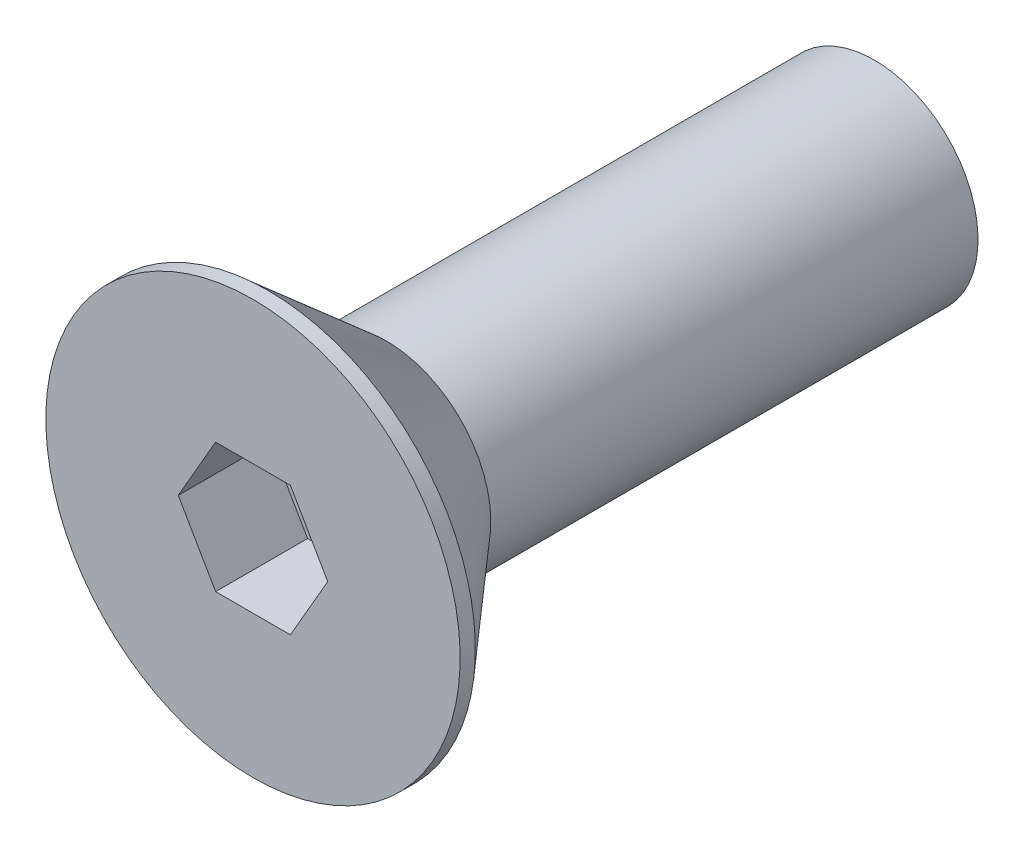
ISO-10303-21;
HEADER;
FILE_DESCRIPTION(('STEP AP214'),'2;1');
FILE_NAME('part.step','',(''),(''),'','','');
FILE_SCHEMA(('AUTOMOTIVE_DESIGN { 1 0 10303 214 1 1 1 1 }'));
ENDSEC;
DATA;
#1=APPLICATION_CONTEXT('core data for automotive mechanical design processes');
#2=APPLICATION_PROTOCOL_DEFINITION('international standard','automotive_design',2000,#1);
#3=PRODUCT_CONTEXT('',#1,'mechanical');
#4=PRODUCT('Part','Part','',(#3));
#5=PRODUCT_RELATED_PRODUCT_CATEGORY('part','',(#4));
#6=PRODUCT_DEFINITION_FORMATION('','',#4);
#7=PRODUCT_DEFINITION_CONTEXT('part definition',#1,'design');
#8=PRODUCT_DEFINITION('design','',#6,#7);
#9=PRODUCT_DEFINITION_SHAPE('','',#8);
#10=(LENGTH_UNIT() NAMED_UNIT(*) SI_UNIT(.MILLI.,.METRE.));
#11=(NAMED_UNIT(*) PLANE_ANGLE_UNIT() SI_UNIT($,.RADIAN.));
#12=(NAMED_UNIT(*) SI_UNIT($,.STERADIAN.) SOLID_ANGLE_UNIT());
#13=UNCERTAINTY_MEASURE_WITH_UNIT(LENGTH_MEASURE(1.E-05),#10,'distance_accuracy_value','');
#14=(GEOMETRIC_REPRESENTATION_CONTEXT(3) GLOBAL_UNCERTAINTY_ASSIGNED_CONTEXT((#13)) GLOBAL_UNIT_ASSIGNED_CONTEXT((#10,
#11,#12)) REPRESENTATION_CONTEXT('',''));
#15=CARTESIAN_POINT('',(0.,0.,0.));
#16=DIRECTION('',(0.,0.,1.));
#17=DIRECTION('',(1.,0.,0.));
#18=AXIS2_PLACEMENT_3D('',#15,#16,#17);
#19=CARTESIAN_POINT('',(0.,0.,4.0894));
#20=DIRECTION('',(0.,0.,-1.));
#21=DIRECTION('',(0.,1.,0.));
#22=AXIS2_PLACEMENT_3D('',#19,#20,#21);
#23=PLANE('',#22);
#24=DIRECTION('',(0.5,0.866025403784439,0.));
#25=VECTOR('',#24,1.);
#26=CARTESIAN_POINT('',(1.14567944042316,-1.984375,4.0894));
#27=LINE('',#26,#25);
#28=CARTESIAN_POINT('',(1.14567944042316,-1.984375,4.0894));
#29=VERTEX_POINT('',#28);
#30=CARTESIAN_POINT('',(2.29135888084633,0.,4.0894));
#31=VERTEX_POINT('',#30);
#32=EDGE_CURVE('E124',#29,#31,#27,.T.);
#33=ORIENTED_EDGE('',*,*,#32,.F.);
#34=DIRECTION('',(1.,0.,0.));
#35=VECTOR('',#34,1.);
#36=CARTESIAN_POINT('',(-1.14567944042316,-1.984375,4.0894));
#37=LINE('',#36,#35);
#38=CARTESIAN_POINT('',(-1.14567944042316,-1.984375,4.0894));
#39=VERTEX_POINT('',#38);
#40=EDGE_CURVE('E50',#39,#29,#37,.T.);
#41=ORIENTED_EDGE('',*,*,#40,.F.);
#42=DIRECTION('',(0.5,-0.866025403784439,0.));
#43=VECTOR('',#42,1.);
#44=CARTESIAN_POINT('',(-2.29135888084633,0.,4.0894));
#45=LINE('',#44,#43);
#46=CARTESIAN_POINT('',(-2.29135888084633,0.,4.0894));
#47=VERTEX_POINT('',#46);
#48=EDGE_CURVE('E133',#47,#39,#45,.T.);
#49=ORIENTED_EDGE('',*,*,#48,.F.);
#50=DIRECTION('',(-0.5,-0.866025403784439,0.));
#51=VECTOR('',#50,1.);
#52=CARTESIAN_POINT('',(-1.14567944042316,1.984375,4.0894));
#53=LINE('',#52,#51);
#54=CARTESIAN_POINT('',(-1.14567944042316,1.984375,4.0894));
#55=VERTEX_POINT('',#54);
#56=EDGE_CURVE('E131',#55,#47,#53,.T.);
#57=ORIENTED_EDGE('',*,*,#56,.F.);
#58=DIRECTION('',(-1.,0.,0.));
#59=VECTOR('',#58,1.);
#60=CARTESIAN_POINT('',(1.14567944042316,1.984375,4.0894));
#61=LINE('',#60,#59);
#62=CARTESIAN_POINT('',(1.14567944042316,1.984375,4.0894));
#63=VERTEX_POINT('',#62);
#64=EDGE_CURVE('E98',#63,#55,#61,.T.);
#65=ORIENTED_EDGE('',*,*,#64,.F.);
#66=DIRECTION('',(-0.5,0.866025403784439,0.));
#67=VECTOR('',#66,1.);
#68=CARTESIAN_POINT('',(2.29135888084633,0.,4.0894));
#69=LINE('',#68,#67);
#70=EDGE_CURVE('E127',#31,#63,#69,.T.);
#71=ORIENTED_EDGE('',*,*,#70,.F.);
#72=EDGE_LOOP('',(#33,#41,#49,#57,#65,#71));
#73=FACE_BOUND('',#72,.T.);
#74=CARTESIAN_POINT('',(0.,0.,4.0894));
#75=DIRECTION('',(0.,0.,1.));
#76=DIRECTION('',(0.,-1.,0.));
#77=AXIS2_PLACEMENT_3D('',#74,#75,#76);
#78=CIRCLE('',#77,6.35);
#79=CARTESIAN_POINT('',(0.,-6.35,4.0894));
#80=VERTEX_POINT('',#79);
#81=EDGE_CURVE('E11',#80,#80,#78,.T.);
#82=ORIENTED_EDGE('',*,*,#81,.T.);
#83=EDGE_LOOP('',(#82));
#84=FACE_BOUND('',#83,.T.);
#85=ADVANCED_FACE('F36',(#73,#84),#23,.F.);
#86=CARTESIAN_POINT('',(0.,0.,5.58488227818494));
#87=DIRECTION('',(0.,0.,1.));
#88=DIRECTION('',(0.,-1.,0.));
#89=AXIS2_PLACEMENT_3D('',#86,#87,#88);
#90=CYLINDRICAL_SURFACE('',#89,6.35);
#91=ORIENTED_EDGE('',*,*,#81,.F.);
#92=EDGE_LOOP('',(#91));
#93=FACE_BOUND('',#92,.T.);
#94=CARTESIAN_POINT('',(0.,0.,3.62320033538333));
#95=DIRECTION('',(0.,0.,1.));
#96=DIRECTION('',(0.,-1.,0.));
#97=AXIS2_PLACEMENT_3D('',#94,#95,#96);
#98=CIRCLE('',#97,6.35);
#99=CARTESIAN_POINT('',(0.,-6.35,3.62320033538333));
#100=VERTEX_POINT('',#99);
#101=EDGE_CURVE('E43',#100,#100,#98,.T.);
#102=ORIENTED_EDGE('',*,*,#101,.T.);
#103=EDGE_LOOP('',(#102));
#104=FACE_BOUND('',#103,.T.);
#105=ADVANCED_FACE('F153',(#93,#104),#90,.T.);
#106=CARTESIAN_POINT('',(0.,0.,0.));
#107=DIRECTION('',(0.,0.,1.));
#108=DIRECTION('',(0.,-1.,0.));
#109=AXIS2_PLACEMENT_3D('',#106,#107,#108);
#110=CONICAL_SURFACE('',#109,3.2004,0.71558499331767);
#111=ORIENTED_EDGE('',*,*,#101,.F.);
#112=EDGE_LOOP('',(#111));
#113=FACE_BOUND('',#112,.T.);
#114=CARTESIAN_POINT('',(0.,0.,0.));
#115=DIRECTION('',(0.,0.,1.));
#116=DIRECTION('',(0.,-1.,0.));
#117=AXIS2_PLACEMENT_3D('',#114,#115,#116);
#118=CIRCLE('',#117,3.2004);
#119=CARTESIAN_POINT('',(0.,-3.2004,0.));
#120=VERTEX_POINT('',#119);
#121=EDGE_CURVE('E148',#120,#120,#118,.T.);
#122=ORIENTED_EDGE('',*,*,#121,.T.);
#123=EDGE_LOOP('',(#122));
#124=FACE_BOUND('',#123,.T.);
#125=ADVANCED_FACE('F155',(#113,#124),#110,.T.);
#126=CARTESIAN_POINT('',(0.,3.2004,0.));
#127=DIRECTION('',(0.,0.,1.));
#128=DIRECTION('',(0.,-1.,0.));
#129=AXIS2_PLACEMENT_3D('',#126,#127,#128);
#130=PLANE('',#129);
#131=ORIENTED_EDGE('',*,*,#121,.F.);
#132=EDGE_LOOP('',(#131));
#133=FACE_BOUND('',#132,.T.);
#134=CARTESIAN_POINT('',(0.,0.,0.));
#135=DIRECTION('',(0.,0.,1.));
#136=DIRECTION('',(0.,-1.,0.));
#137=AXIS2_PLACEMENT_3D('',#134,#135,#136);
#138=CIRCLE('',#137,3.175);
#139=CARTESIAN_POINT('',(0.,-3.175,0.));
#140=VERTEX_POINT('',#139);
#141=EDGE_CURVE('E145',#140,#140,#138,.T.);
#142=ORIENTED_EDGE('',*,*,#141,.T.);
#143=EDGE_LOOP('',(#142));
#144=FACE_BOUND('',#143,.T.);
#145=ADVANCED_FACE('F158',(#133,#144),#130,.F.);
#146=CARTESIAN_POINT('',(0.,0.,5.58488227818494));
#147=DIRECTION('',(0.,0.,1.));
#148=DIRECTION('',(0.,-1.,0.));
#149=AXIS2_PLACEMENT_3D('',#146,#147,#148);
#150=CYLINDRICAL_SURFACE('',#149,3.175);
#151=ORIENTED_EDGE('',*,*,#141,.F.);
#152=EDGE_LOOP('',(#151));
#153=FACE_BOUND('',#152,.T.);
#154=CARTESIAN_POINT('',(0.,0.,-14.9606));
#155=DIRECTION('',(0.,0.,1.));
#156=DIRECTION('',(0.,-1.,0.));
#157=AXIS2_PLACEMENT_3D('',#154,#155,#156);
#158=CIRCLE('',#157,3.175);
#159=CARTESIAN_POINT('',(0.,-3.175,-14.9606));
#160=VERTEX_POINT('',#159);
#161=EDGE_CURVE('E137',#160,#160,#158,.T.);
#162=ORIENTED_EDGE('',*,*,#161,.T.);
#163=EDGE_LOOP('',(#162));
#164=FACE_BOUND('',#163,.T.);
#165=ADVANCED_FACE('F164',(#153,#164),#150,.T.);
#166=CARTESIAN_POINT('',(0.,3.175,-14.9606));
#167=DIRECTION('',(0.,0.,1.));
#168=DIRECTION('',(0.,-1.,0.));
#169=AXIS2_PLACEMENT_3D('',#166,#167,#168);
#170=PLANE('',#169);
#171=ORIENTED_EDGE('',*,*,#161,.F.);
#172=EDGE_LOOP('',(#171));
#173=FACE_BOUND('',#172,.T.);
#174=ADVANCED_FACE('F170',(#173),#170,.F.);
#175=CARTESIAN_POINT('',(-1.14567944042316,-1.984375,1.27));
#176=DIRECTION('',(0.,-1.,0.));
#177=DIRECTION('',(1.,0.,0.));
#178=AXIS2_PLACEMENT_3D('',#175,#176,#177);
#179=PLANE('',#178);
#180=ORIENTED_EDGE('',*,*,#40,.T.);
#181=DIRECTION('',(0.,0.,1.));
#182=VECTOR('',#181,1.);
#183=CARTESIAN_POINT('',(1.14567944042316,-1.984375,1.27));
#184=LINE('',#183,#182);
#185=CARTESIAN_POINT('',(1.14567944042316,-1.984375,1.27));
#186=VERTEX_POINT('',#185);
#187=EDGE_CURVE('E80',#186,#29,#184,.T.);
#188=ORIENTED_EDGE('',*,*,#187,.F.);
#189=DIRECTION('',(1.,0.,0.));
#190=VECTOR('',#189,1.);
#191=CARTESIAN_POINT('',(-1.14567944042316,-1.984375,1.27));
#192=LINE('',#191,#190);
#193=CARTESIAN_POINT('',(-1.14567944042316,-1.984375,1.27));
#194=VERTEX_POINT('',#193);
#195=EDGE_CURVE('E135',#194,#186,#192,.T.);
#196=ORIENTED_EDGE('',*,*,#195,.F.);
#197=DIRECTION('',(0.,0.,1.));
#198=VECTOR('',#197,1.);
#199=CARTESIAN_POINT('',(-1.14567944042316,-1.984375,1.27));
#200=LINE('',#199,#198);
#201=EDGE_CURVE('E58',#194,#39,#200,.T.);
#202=ORIENTED_EDGE('',*,*,#201,.T.);
#203=EDGE_LOOP('',(#180,#188,#196,#202));
#204=FACE_BOUND('',#203,.T.);
#205=ADVANCED_FACE('F175',(#204),#179,.F.);
#206=CARTESIAN_POINT('',(-2.29135888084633,0.,1.27));
#207=DIRECTION('',(-0.866025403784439,-0.5,0.));
#208=DIRECTION('',(0.5,-0.866025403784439,0.));
#209=AXIS2_PLACEMENT_3D('',#206,#207,#208);
#210=PLANE('',#209);
#211=ORIENTED_EDGE('',*,*,#48,.T.);
#212=ORIENTED_EDGE('',*,*,#201,.F.);
#213=DIRECTION('',(0.5,-0.866025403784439,0.));
#214=VECTOR('',#213,1.);
#215=CARTESIAN_POINT('',(-2.29135888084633,0.,1.27));
#216=LINE('',#215,#214);
#217=CARTESIAN_POINT('',(-2.29135888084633,0.,1.27));
#218=VERTEX_POINT('',#217);
#219=EDGE_CURVE('E110',#218,#194,#216,.T.);
#220=ORIENTED_EDGE('',*,*,#219,.F.);
#221=DIRECTION('',(0.,0.,1.));
#222=VECTOR('',#221,1.);
#223=CARTESIAN_POINT('',(-2.29135888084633,0.,1.27));
#224=LINE('',#223,#222);
#225=EDGE_CURVE('E102',#218,#47,#224,.T.);
#226=ORIENTED_EDGE('',*,*,#225,.T.);
#227=EDGE_LOOP('',(#211,#212,#220,#226));
#228=FACE_BOUND('',#227,.T.);
#229=ADVANCED_FACE('F180',(#228),#210,.F.);
#230=CARTESIAN_POINT('',(-1.14567944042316,1.984375,1.27));
#231=DIRECTION('',(-0.866025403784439,0.5,0.));
#232=DIRECTION('',(-0.5,-0.866025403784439,0.));
#233=AXIS2_PLACEMENT_3D('',#230,#231,#232);
#234=PLANE('',#233);
#235=ORIENTED_EDGE('',*,*,#56,.T.);
#236=ORIENTED_EDGE('',*,*,#225,.F.);
#237=DIRECTION('',(-0.5,-0.866025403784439,0.));
#238=VECTOR('',#237,1.);
#239=CARTESIAN_POINT('',(-1.14567944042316,1.984375,1.27));
#240=LINE('',#239,#238);
#241=CARTESIAN_POINT('',(-1.14567944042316,1.984375,1.27));
#242=VERTEX_POINT('',#241);
#243=EDGE_CURVE('E106',#242,#218,#240,.T.);
#244=ORIENTED_EDGE('',*,*,#243,.F.);
#245=DIRECTION('',(0.,0.,1.));
#246=VECTOR('',#245,1.);
#247=CARTESIAN_POINT('',(-1.14567944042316,1.984375,1.27));
#248=LINE('',#247,#246);
#249=EDGE_CURVE('E91',#242,#55,#248,.T.);
#250=ORIENTED_EDGE('',*,*,#249,.T.);
#251=EDGE_LOOP('',(#235,#236,#244,#250));
#252=FACE_BOUND('',#251,.T.);
#253=ADVANCED_FACE('F107',(#252),#234,.F.);
#254=CARTESIAN_POINT('',(1.14567944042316,1.984375,1.27));
#255=DIRECTION('',(0.,1.,0.));
#256=DIRECTION('',(0.,0.,1.));
#257=AXIS2_PLACEMENT_3D('',#254,#255,#256);
#258=PLANE('',#257);
#259=ORIENTED_EDGE('',*,*,#64,.T.);
#260=ORIENTED_EDGE('',*,*,#249,.F.);
#261=DIRECTION('',(-1.,0.,0.));
#262=VECTOR('',#261,1.);
#263=CARTESIAN_POINT('',(1.14567944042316,1.984375,1.27));
#264=LINE('',#263,#262);
#265=CARTESIAN_POINT('',(1.14567944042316,1.984375,1.27));
#266=VERTEX_POINT('',#265);
#267=EDGE_CURVE('E95',#266,#242,#264,.T.);
#268=ORIENTED_EDGE('',*,*,#267,.F.);
#269=DIRECTION('',(0.,0.,1.));
#270=VECTOR('',#269,1.);
#271=CARTESIAN_POINT('',(1.14567944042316,1.984375,1.27));
#272=LINE('',#271,#270);
#273=EDGE_CURVE('E103',#266,#63,#272,.T.);
#274=ORIENTED_EDGE('',*,*,#273,.T.);
#275=EDGE_LOOP('',(#259,#260,#268,#274));
#276=FACE_BOUND('',#275,.T.);
#277=ADVANCED_FACE('F93',(#276),#258,.F.);
#278=CARTESIAN_POINT('',(2.29135888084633,0.,1.27));
#279=DIRECTION('',(0.866025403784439,0.5,0.));
#280=DIRECTION('',(-0.5,0.866025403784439,0.));
#281=AXIS2_PLACEMENT_3D('',#278,#279,#280);
#282=PLANE('',#281);
#283=ORIENTED_EDGE('',*,*,#70,.T.);
#284=ORIENTED_EDGE('',*,*,#273,.F.);
#285=DIRECTION('',(-0.5,0.866025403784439,0.));
#286=VECTOR('',#285,1.);
#287=CARTESIAN_POINT('',(2.29135888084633,0.,1.27));
#288=LINE('',#287,#286);
#289=CARTESIAN_POINT('',(2.29135888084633,0.,1.27));
#290=VERTEX_POINT('',#289);
#291=EDGE_CURVE('E116',#290,#266,#288,.T.);
#292=ORIENTED_EDGE('',*,*,#291,.F.);
#293=DIRECTION('',(0.,0.,1.));
#294=VECTOR('',#293,1.);
#295=CARTESIAN_POINT('',(2.29135888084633,0.,1.27));
#296=LINE('',#295,#294);
#297=EDGE_CURVE('E140',#290,#31,#296,.T.);
#298=ORIENTED_EDGE('',*,*,#297,.T.);
#299=EDGE_LOOP('',(#283,#284,#292,#298));
#300=FACE_BOUND('',#299,.T.);
#301=ADVANCED_FACE('F206',(#300),#282,.F.);
#302=CARTESIAN_POINT('',(1.14567944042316,-1.984375,1.27));
#303=DIRECTION('',(0.866025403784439,-0.5,0.));
#304=DIRECTION('',(0.5,0.866025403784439,0.));
#305=AXIS2_PLACEMENT_3D('',#302,#303,#304);
#306=PLANE('',#305);
#307=ORIENTED_EDGE('',*,*,#32,.T.);
#308=ORIENTED_EDGE('',*,*,#297,.F.);
#309=DIRECTION('',(0.5,0.866025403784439,0.));
#310=VECTOR('',#309,1.);
#311=CARTESIAN_POINT('',(1.14567944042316,-1.984375,1.27));
#312=LINE('',#311,#310);
#313=EDGE_CURVE('E118',#186,#290,#312,.T.);
#314=ORIENTED_EDGE('',*,*,#313,.F.);
#315=ORIENTED_EDGE('',*,*,#187,.T.);
#316=EDGE_LOOP('',(#307,#308,#314,#315));
#317=FACE_BOUND('',#316,.T.);
#318=ADVANCED_FACE('F194',(#317),#306,.F.);
#319=CARTESIAN_POINT('',(-1.14567944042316,-1.984375,1.27));
#320=DIRECTION('',(0.,0.,-1.));
#321=DIRECTION('',(-1.,0.,0.));
#322=AXIS2_PLACEMENT_3D('',#319,#320,#321);
#323=PLANE('',#322);
#324=ORIENTED_EDGE('',*,*,#195,.T.);
#325=ORIENTED_EDGE('',*,*,#313,.T.);
#326=ORIENTED_EDGE('',*,*,#291,.T.);
#327=ORIENTED_EDGE('',*,*,#267,.T.);
#328=ORIENTED_EDGE('',*,*,#243,.T.);
#329=ORIENTED_EDGE('',*,*,#219,.T.);
#330=EDGE_LOOP('',(#324,#325,#326,#327,#328,#329));
#331=FACE_BOUND('',#330,.T.);
#332=ADVANCED_FACE('F113',(#331),#323,.F.);
#333=CLOSED_SHELL('',(#85,#105,#125,#145,#165,#174,#205,#229,#253,#277,#301,#318,#332));
#334=MANIFOLD_SOLID_BREP('B2',#333);
#335=ADVANCED_BREP_SHAPE_REPRESENTATION('',(#18,#334),#14);
#336=SHAPE_DEFINITION_REPRESENTATION(#9,#335);
ENDSEC;
END-ISO-10303-21;
